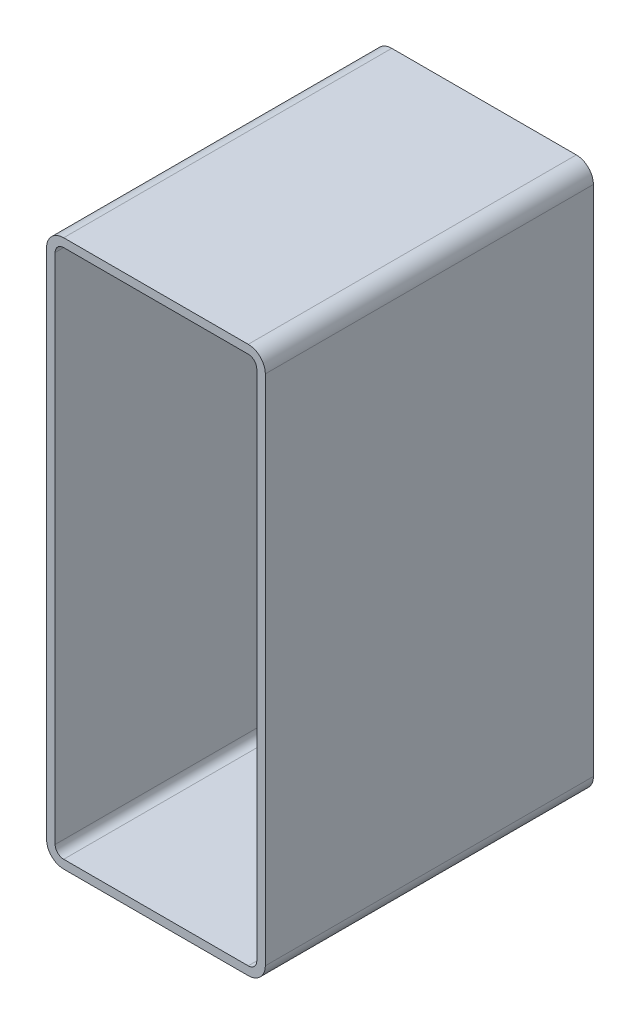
ISO-10303-21;
HEADER;
FILE_DESCRIPTION(('STEP AP214'),'2;1');
FILE_NAME('part.step','',(''),(''),'','','');
FILE_SCHEMA(('AUTOMOTIVE_DESIGN { 1 0 10303 214 1 1 1 1 }'));
ENDSEC;
DATA;
#1=APPLICATION_CONTEXT('core data for automotive mechanical design processes');
#2=APPLICATION_PROTOCOL_DEFINITION('international standard','automotive_design',2000,#1);
#3=PRODUCT_CONTEXT('',#1,'mechanical');
#4=PRODUCT('Part','Part','',(#3));
#5=PRODUCT_RELATED_PRODUCT_CATEGORY('part','',(#4));
#6=PRODUCT_DEFINITION_FORMATION('','',#4);
#7=PRODUCT_DEFINITION_CONTEXT('part definition',#1,'design');
#8=PRODUCT_DEFINITION('design','',#6,#7);
#9=PRODUCT_DEFINITION_SHAPE('','',#8);
#10=(LENGTH_UNIT() NAMED_UNIT(*) SI_UNIT(.MILLI.,.METRE.));
#11=(NAMED_UNIT(*) PLANE_ANGLE_UNIT() SI_UNIT($,.RADIAN.));
#12=(NAMED_UNIT(*) SI_UNIT($,.STERADIAN.) SOLID_ANGLE_UNIT());
#13=UNCERTAINTY_MEASURE_WITH_UNIT(LENGTH_MEASURE(1.E-05),#10,'distance_accuracy_value','');
#14=(GEOMETRIC_REPRESENTATION_CONTEXT(3) GLOBAL_UNCERTAINTY_ASSIGNED_CONTEXT((#13)) GLOBAL_UNIT_ASSIGNED_CONTEXT((#10,
#11,#12)) REPRESENTATION_CONTEXT('',''));
#15=CARTESIAN_POINT('',(0.,0.,0.));
#16=DIRECTION('',(0.,0.,1.));
#17=DIRECTION('',(1.,0.,0.));
#18=AXIS2_PLACEMENT_3D('',#15,#16,#17);
#19=CARTESIAN_POINT('',(17.2659404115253,17.5662282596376,304.8));
#20=DIRECTION('',(0.,0.,1.));
#21=DIRECTION('',(1.,0.,0.));
#22=AXIS2_PLACEMENT_3D('',#19,#20,#21);
#23=PLANE('',#22);
#24=CARTESIAN_POINT('',(17.2659404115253,17.5662282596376,304.8));
#25=DIRECTION('',(0.,0.,1.));
#26=DIRECTION('',(1.,0.,0.));
#27=AXIS2_PLACEMENT_3D('',#24,#25,#26);
#28=CIRCLE('',#27,15.875);
#29=CARTESIAN_POINT('',(1.3909404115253,17.5662282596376,304.8));
#30=VERTEX_POINT('',#29);
#31=CARTESIAN_POINT('',(17.2659404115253,1.69122825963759,304.8));
#32=VERTEX_POINT('',#31);
#33=EDGE_CURVE('E211',#30,#32,#28,.T.);
#34=ORIENTED_EDGE('',*,*,#33,.T.);
#35=DIRECTION('',(1.,0.,0.));
#36=VECTOR('',#35,1.);
#37=CARTESIAN_POINT('',(188.715940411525,1.69122825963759,304.8));
#38=LINE('',#37,#36);
#39=CARTESIAN_POINT('',(188.715940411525,1.69122825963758,304.8));
#40=VERTEX_POINT('',#39);
#41=EDGE_CURVE('E214',#32,#40,#38,.T.);
#42=ORIENTED_EDGE('',*,*,#41,.T.);
#43=CARTESIAN_POINT('',(188.715940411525,17.5662282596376,304.8));
#44=DIRECTION('',(0.,0.,1.));
#45=DIRECTION('',(1.,0.,0.));
#46=AXIS2_PLACEMENT_3D('',#43,#44,#45);
#47=CIRCLE('',#46,15.875);
#48=CARTESIAN_POINT('',(204.590940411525,17.5662282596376,304.8));
#49=VERTEX_POINT('',#48);
#50=EDGE_CURVE('E217',#40,#49,#47,.T.);
#51=ORIENTED_EDGE('',*,*,#50,.T.);
#52=DIRECTION('',(0.,1.,0.));
#53=VECTOR('',#52,1.);
#54=CARTESIAN_POINT('',(204.590940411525,493.816228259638,304.8));
#55=LINE('',#54,#53);
#56=CARTESIAN_POINT('',(204.590940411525,493.816228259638,304.8));
#57=VERTEX_POINT('',#56);
#58=EDGE_CURVE('E219',#49,#57,#55,.T.);
#59=ORIENTED_EDGE('',*,*,#58,.T.);
#60=CARTESIAN_POINT('',(188.715940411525,493.816228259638,304.8));
#61=DIRECTION('',(0.,0.,1.));
#62=DIRECTION('',(1.,0.,0.));
#63=AXIS2_PLACEMENT_3D('',#60,#61,#62);
#64=CIRCLE('',#63,15.875);
#65=CARTESIAN_POINT('',(188.715940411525,509.691228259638,304.8));
#66=VERTEX_POINT('',#65);
#67=EDGE_CURVE('E221',#57,#66,#64,.T.);
#68=ORIENTED_EDGE('',*,*,#67,.T.);
#69=DIRECTION('',(-1.,0.,0.));
#70=VECTOR('',#69,1.);
#71=CARTESIAN_POINT('',(17.2659404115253,509.691228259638,304.8));
#72=LINE('',#71,#70);
#73=CARTESIAN_POINT('',(17.2659404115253,509.691228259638,304.8));
#74=VERTEX_POINT('',#73);
#75=EDGE_CURVE('E223',#66,#74,#72,.T.);
#76=ORIENTED_EDGE('',*,*,#75,.T.);
#77=CARTESIAN_POINT('',(17.2659404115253,493.816228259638,304.8));
#78=DIRECTION('',(0.,0.,1.));
#79=DIRECTION('',(1.,0.,0.));
#80=AXIS2_PLACEMENT_3D('',#77,#78,#79);
#81=CIRCLE('',#80,15.875);
#82=CARTESIAN_POINT('',(1.3909404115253,493.816228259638,304.8));
#83=VERTEX_POINT('',#82);
#84=EDGE_CURVE('E225',#74,#83,#81,.T.);
#85=ORIENTED_EDGE('',*,*,#84,.T.);
#86=DIRECTION('',(0.,-1.,0.));
#87=VECTOR('',#86,1.);
#88=CARTESIAN_POINT('',(1.3909404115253,17.5662282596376,304.8));
#89=LINE('',#88,#87);
#90=EDGE_CURVE('E227',#83,#30,#89,.T.);
#91=ORIENTED_EDGE('',*,*,#90,.T.);
#92=EDGE_LOOP('',(#34,#42,#51,#59,#68,#76,#85,#91));
#93=FACE_BOUND('',#92,.T.);
#94=DIRECTION('',(0.,-1.,0.));
#95=VECTOR('',#94,1.);
#96=CARTESIAN_POINT('',(9.3284404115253,17.5662282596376,304.8));
#97=LINE('',#96,#95);
#98=CARTESIAN_POINT('',(9.3284404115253,493.816228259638,304.8));
#99=VERTEX_POINT('',#98);
#100=CARTESIAN_POINT('',(9.3284404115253,17.5662282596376,304.8));
#101=VERTEX_POINT('',#100);
#102=EDGE_CURVE('E154',#99,#101,#97,.T.);
#103=ORIENTED_EDGE('',*,*,#102,.F.);
#104=CARTESIAN_POINT('',(17.2659404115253,493.816228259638,304.8));
#105=DIRECTION('',(0.,0.,1.));
#106=DIRECTION('',(1.,0.,0.));
#107=AXIS2_PLACEMENT_3D('',#104,#105,#106);
#108=CIRCLE('',#107,7.93750000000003);
#109=CARTESIAN_POINT('',(17.2659404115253,501.753728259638,304.8));
#110=VERTEX_POINT('',#109);
#111=EDGE_CURVE('E146',#110,#99,#108,.T.);
#112=ORIENTED_EDGE('',*,*,#111,.F.);
#113=DIRECTION('',(-1.,0.,0.));
#114=VECTOR('',#113,1.);
#115=CARTESIAN_POINT('',(17.2659404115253,501.753728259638,304.8));
#116=LINE('',#115,#114);
#117=CARTESIAN_POINT('',(188.715940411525,501.753728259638,304.8));
#118=VERTEX_POINT('',#117);
#119=EDGE_CURVE('E179',#118,#110,#116,.T.);
#120=ORIENTED_EDGE('',*,*,#119,.F.);
#121=CARTESIAN_POINT('',(188.715940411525,493.816228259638,304.8));
#122=DIRECTION('',(0.,0.,1.));
#123=DIRECTION('',(1.,0.,0.));
#124=AXIS2_PLACEMENT_3D('',#121,#122,#123);
#125=CIRCLE('',#124,7.93750000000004);
#126=CARTESIAN_POINT('',(196.653440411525,493.816228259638,304.8));
#127=VERTEX_POINT('',#126);
#128=EDGE_CURVE('E177',#127,#118,#125,.T.);
#129=ORIENTED_EDGE('',*,*,#128,.F.);
#130=DIRECTION('',(0.,1.,0.));
#131=VECTOR('',#130,1.);
#132=CARTESIAN_POINT('',(196.653440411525,493.816228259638,304.8));
#133=LINE('',#132,#131);
#134=CARTESIAN_POINT('',(196.653440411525,17.5662282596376,304.8));
#135=VERTEX_POINT('',#134);
#136=EDGE_CURVE('E175',#135,#127,#133,.T.);
#137=ORIENTED_EDGE('',*,*,#136,.F.);
#138=CARTESIAN_POINT('',(188.715940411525,17.5662282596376,304.8));
#139=DIRECTION('',(0.,0.,1.));
#140=DIRECTION('',(1.,0.,0.));
#141=AXIS2_PLACEMENT_3D('',#138,#139,#140);
#142=CIRCLE('',#141,7.93750000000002);
#143=CARTESIAN_POINT('',(188.715940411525,9.62872825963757,304.8));
#144=VERTEX_POINT('',#143);
#145=EDGE_CURVE('E173',#144,#135,#142,.T.);
#146=ORIENTED_EDGE('',*,*,#145,.F.);
#147=DIRECTION('',(1.,0.,0.));
#148=VECTOR('',#147,1.);
#149=CARTESIAN_POINT('',(188.715940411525,9.62872825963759,304.8));
#150=LINE('',#149,#148);
#151=CARTESIAN_POINT('',(17.2659404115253,9.62872825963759,304.8));
#152=VERTEX_POINT('',#151);
#153=EDGE_CURVE('E169',#152,#144,#150,.T.);
#154=ORIENTED_EDGE('',*,*,#153,.F.);
#155=CARTESIAN_POINT('',(17.2659404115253,17.5662282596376,304.8));
#156=DIRECTION('',(0.,0.,1.));
#157=DIRECTION('',(1.,0.,0.));
#158=AXIS2_PLACEMENT_3D('',#155,#156,#157);
#159=CIRCLE('',#158,7.9375);
#160=EDGE_CURVE('E167',#101,#152,#159,.T.);
#161=ORIENTED_EDGE('',*,*,#160,.F.);
#162=EDGE_LOOP('',(#103,#112,#120,#129,#137,#146,#154,#161));
#163=FACE_BOUND('',#162,.T.);
#164=ADVANCED_FACE('F33',(#93,#163),#23,.T.);
#165=CARTESIAN_POINT('',(17.2659404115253,17.5662282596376,0.));
#166=DIRECTION('',(0.,0.,1.));
#167=DIRECTION('',(1.,0.,0.));
#168=AXIS2_PLACEMENT_3D('',#165,#166,#167);
#169=PLANE('',#168);
#170=CARTESIAN_POINT('',(17.2659404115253,17.5662282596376,0.));
#171=DIRECTION('',(0.,0.,1.));
#172=DIRECTION('',(1.,0.,0.));
#173=AXIS2_PLACEMENT_3D('',#170,#171,#172);
#174=CIRCLE('',#173,15.875);
#175=CARTESIAN_POINT('',(1.3909404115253,17.5662282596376,0.));
#176=VERTEX_POINT('',#175);
#177=CARTESIAN_POINT('',(17.2659404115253,1.69122825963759,0.));
#178=VERTEX_POINT('',#177);
#179=EDGE_CURVE('E162',#176,#178,#174,.T.);
#180=ORIENTED_EDGE('',*,*,#179,.F.);
#181=DIRECTION('',(0.,-1.,0.));
#182=VECTOR('',#181,1.);
#183=CARTESIAN_POINT('',(1.3909404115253,17.5662282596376,0.));
#184=LINE('',#183,#182);
#185=CARTESIAN_POINT('',(1.3909404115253,493.816228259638,0.));
#186=VERTEX_POINT('',#185);
#187=EDGE_CURVE('E215',#186,#176,#184,.T.);
#188=ORIENTED_EDGE('',*,*,#187,.F.);
#189=CARTESIAN_POINT('',(17.2659404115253,493.816228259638,0.));
#190=DIRECTION('',(0.,0.,1.));
#191=DIRECTION('',(1.,0.,0.));
#192=AXIS2_PLACEMENT_3D('',#189,#190,#191);
#193=CIRCLE('',#192,15.875);
#194=CARTESIAN_POINT('',(17.2659404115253,509.691228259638,0.));
#195=VERTEX_POINT('',#194);
#196=EDGE_CURVE('E242',#195,#186,#193,.T.);
#197=ORIENTED_EDGE('',*,*,#196,.F.);
#198=DIRECTION('',(-1.,0.,0.));
#199=VECTOR('',#198,1.);
#200=CARTESIAN_POINT('',(17.2659404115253,509.691228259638,0.));
#201=LINE('',#200,#199);
#202=CARTESIAN_POINT('',(188.715940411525,509.691228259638,0.));
#203=VERTEX_POINT('',#202);
#204=EDGE_CURVE('E240',#203,#195,#201,.T.);
#205=ORIENTED_EDGE('',*,*,#204,.F.);
#206=CARTESIAN_POINT('',(188.715940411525,493.816228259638,0.));
#207=DIRECTION('',(0.,0.,1.));
#208=DIRECTION('',(1.,0.,0.));
#209=AXIS2_PLACEMENT_3D('',#206,#207,#208);
#210=CIRCLE('',#209,15.875);
#211=CARTESIAN_POINT('',(204.590940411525,493.816228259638,0.));
#212=VERTEX_POINT('',#211);
#213=EDGE_CURVE('E238',#212,#203,#210,.T.);
#214=ORIENTED_EDGE('',*,*,#213,.F.);
#215=DIRECTION('',(0.,1.,0.));
#216=VECTOR('',#215,1.);
#217=CARTESIAN_POINT('',(204.590940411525,493.816228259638,0.));
#218=LINE('',#217,#216);
#219=CARTESIAN_POINT('',(204.590940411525,17.5662282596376,0.));
#220=VERTEX_POINT('',#219);
#221=EDGE_CURVE('E236',#220,#212,#218,.T.);
#222=ORIENTED_EDGE('',*,*,#221,.F.);
#223=CARTESIAN_POINT('',(188.715940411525,17.5662282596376,0.));
#224=DIRECTION('',(0.,0.,1.));
#225=DIRECTION('',(1.,0.,0.));
#226=AXIS2_PLACEMENT_3D('',#223,#224,#225);
#227=CIRCLE('',#226,15.875);
#228=CARTESIAN_POINT('',(188.715940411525,1.69122825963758,0.));
#229=VERTEX_POINT('',#228);
#230=EDGE_CURVE('E234',#229,#220,#227,.T.);
#231=ORIENTED_EDGE('',*,*,#230,.F.);
#232=DIRECTION('',(1.,0.,0.));
#233=VECTOR('',#232,1.);
#234=CARTESIAN_POINT('',(188.715940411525,1.69122825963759,0.));
#235=LINE('',#234,#233);
#236=EDGE_CURVE('E232',#178,#229,#235,.T.);
#237=ORIENTED_EDGE('',*,*,#236,.F.);
#238=EDGE_LOOP('',(#180,#188,#197,#205,#214,#222,#231,#237));
#239=FACE_BOUND('',#238,.T.);
#240=CARTESIAN_POINT('',(17.2659404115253,493.816228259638,0.));
#241=DIRECTION('',(0.,0.,1.));
#242=DIRECTION('',(1.,0.,0.));
#243=AXIS2_PLACEMENT_3D('',#240,#241,#242);
#244=CIRCLE('',#243,7.93750000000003);
#245=CARTESIAN_POINT('',(17.2659404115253,501.753728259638,0.));
#246=VERTEX_POINT('',#245);
#247=CARTESIAN_POINT('',(9.3284404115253,493.816228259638,0.));
#248=VERTEX_POINT('',#247);
#249=EDGE_CURVE('E56',#246,#248,#244,.T.);
#250=ORIENTED_EDGE('',*,*,#249,.T.);
#251=DIRECTION('',(0.,-1.,0.));
#252=VECTOR('',#251,1.);
#253=CARTESIAN_POINT('',(9.3284404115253,17.5662282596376,0.));
#254=LINE('',#253,#252);
#255=CARTESIAN_POINT('',(9.3284404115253,17.5662282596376,0.));
#256=VERTEX_POINT('',#255);
#257=EDGE_CURVE('E161',#248,#256,#254,.T.);
#258=ORIENTED_EDGE('',*,*,#257,.T.);
#259=CARTESIAN_POINT('',(17.2659404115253,17.5662282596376,0.));
#260=DIRECTION('',(0.,0.,1.));
#261=DIRECTION('',(1.,0.,0.));
#262=AXIS2_PLACEMENT_3D('',#259,#260,#261);
#263=CIRCLE('',#262,7.9375);
#264=CARTESIAN_POINT('',(17.2659404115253,9.62872825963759,0.));
#265=VERTEX_POINT('',#264);
#266=EDGE_CURVE('E183',#256,#265,#263,.T.);
#267=ORIENTED_EDGE('',*,*,#266,.T.);
#268=DIRECTION('',(1.,0.,0.));
#269=VECTOR('',#268,1.);
#270=CARTESIAN_POINT('',(188.715940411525,9.62872825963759,0.));
#271=LINE('',#270,#269);
#272=CARTESIAN_POINT('',(188.715940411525,9.62872825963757,0.));
#273=VERTEX_POINT('',#272);
#274=EDGE_CURVE('E186',#265,#273,#271,.T.);
#275=ORIENTED_EDGE('',*,*,#274,.T.);
#276=CARTESIAN_POINT('',(188.715940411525,17.5662282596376,0.));
#277=DIRECTION('',(0.,0.,1.));
#278=DIRECTION('',(1.,0.,0.));
#279=AXIS2_PLACEMENT_3D('',#276,#277,#278);
#280=CIRCLE('',#279,7.93750000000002);
#281=CARTESIAN_POINT('',(196.653440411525,17.5662282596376,0.));
#282=VERTEX_POINT('',#281);
#283=EDGE_CURVE('E189',#273,#282,#280,.T.);
#284=ORIENTED_EDGE('',*,*,#283,.T.);
#285=DIRECTION('',(0.,1.,0.));
#286=VECTOR('',#285,1.);
#287=CARTESIAN_POINT('',(196.653440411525,493.816228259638,0.));
#288=LINE('',#287,#286);
#289=CARTESIAN_POINT('',(196.653440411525,493.816228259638,0.));
#290=VERTEX_POINT('',#289);
#291=EDGE_CURVE('E192',#282,#290,#288,.T.);
#292=ORIENTED_EDGE('',*,*,#291,.T.);
#293=CARTESIAN_POINT('',(188.715940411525,493.816228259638,0.));
#294=DIRECTION('',(0.,0.,1.));
#295=DIRECTION('',(1.,0.,0.));
#296=AXIS2_PLACEMENT_3D('',#293,#294,#295);
#297=CIRCLE('',#296,7.93750000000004);
#298=CARTESIAN_POINT('',(188.715940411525,501.753728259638,0.));
#299=VERTEX_POINT('',#298);
#300=EDGE_CURVE('E195',#290,#299,#297,.T.);
#301=ORIENTED_EDGE('',*,*,#300,.T.);
#302=DIRECTION('',(-1.,0.,0.));
#303=VECTOR('',#302,1.);
#304=CARTESIAN_POINT('',(17.2659404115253,501.753728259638,0.));
#305=LINE('',#304,#303);
#306=EDGE_CURVE('E155',#299,#246,#305,.T.);
#307=ORIENTED_EDGE('',*,*,#306,.T.);
#308=EDGE_LOOP('',(#250,#258,#267,#275,#284,#292,#301,#307));
#309=FACE_BOUND('',#308,.T.);
#310=ADVANCED_FACE('F272',(#239,#309),#169,.F.);
#311=CARTESIAN_POINT('',(17.2659404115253,17.5662282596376,304.8));
#312=DIRECTION('',(0.,0.,-1.));
#313=DIRECTION('',(-1.,0.,0.));
#314=AXIS2_PLACEMENT_3D('',#311,#312,#313);
#315=CYLINDRICAL_SURFACE('',#314,15.875);
#316=ORIENTED_EDGE('',*,*,#179,.T.);
#317=DIRECTION('',(0.,0.,-1.));
#318=VECTOR('',#317,1.);
#319=CARTESIAN_POINT('',(17.2659404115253,1.69122825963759,304.8));
#320=LINE('',#319,#318);
#321=EDGE_CURVE('E11',#32,#178,#320,.T.);
#322=ORIENTED_EDGE('',*,*,#321,.F.);
#323=ORIENTED_EDGE('',*,*,#33,.F.);
#324=DIRECTION('',(0.,0.,-1.));
#325=VECTOR('',#324,1.);
#326=CARTESIAN_POINT('',(1.3909404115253,17.5662282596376,304.8));
#327=LINE('',#326,#325);
#328=EDGE_CURVE('E229',#30,#176,#327,.T.);
#329=ORIENTED_EDGE('',*,*,#328,.T.);
#330=EDGE_LOOP('',(#316,#322,#323,#329));
#331=FACE_BOUND('',#330,.T.);
#332=ADVANCED_FACE('F35',(#331),#315,.T.);
#333=CARTESIAN_POINT('',(188.715940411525,1.69122825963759,304.8));
#334=DIRECTION('',(0.,1.,0.));
#335=DIRECTION('',(0.,0.,1.));
#336=AXIS2_PLACEMENT_3D('',#333,#334,#335);
#337=PLANE('',#336);
#338=ORIENTED_EDGE('',*,*,#236,.T.);
#339=DIRECTION('',(0.,0.,-1.));
#340=VECTOR('',#339,1.);
#341=CARTESIAN_POINT('',(188.715940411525,1.69122825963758,304.8));
#342=LINE('',#341,#340);
#343=EDGE_CURVE('E41',#40,#229,#342,.T.);
#344=ORIENTED_EDGE('',*,*,#343,.F.);
#345=ORIENTED_EDGE('',*,*,#41,.F.);
#346=ORIENTED_EDGE('',*,*,#321,.T.);
#347=EDGE_LOOP('',(#338,#344,#345,#346));
#348=FACE_BOUND('',#347,.T.);
#349=ADVANCED_FACE('F289',(#348),#337,.F.);
#350=CARTESIAN_POINT('',(188.715940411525,17.5662282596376,304.8));
#351=DIRECTION('',(0.,0.,-1.));
#352=DIRECTION('',(-1.,0.,0.));
#353=AXIS2_PLACEMENT_3D('',#350,#351,#352);
#354=CYLINDRICAL_SURFACE('',#353,15.875);
#355=ORIENTED_EDGE('',*,*,#230,.T.);
#356=DIRECTION('',(0.,0.,-1.));
#357=VECTOR('',#356,1.);
#358=CARTESIAN_POINT('',(204.590940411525,17.5662282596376,304.8));
#359=LINE('',#358,#357);
#360=EDGE_CURVE('E259',#49,#220,#359,.T.);
#361=ORIENTED_EDGE('',*,*,#360,.F.);
#362=ORIENTED_EDGE('',*,*,#50,.F.);
#363=ORIENTED_EDGE('',*,*,#343,.T.);
#364=EDGE_LOOP('',(#355,#361,#362,#363));
#365=FACE_BOUND('',#364,.T.);
#366=ADVANCED_FACE('F266',(#365),#354,.T.);
#367=CARTESIAN_POINT('',(204.590940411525,493.816228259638,304.8));
#368=DIRECTION('',(-1.,0.,0.));
#369=DIRECTION('',(0.,0.,1.));
#370=AXIS2_PLACEMENT_3D('',#367,#368,#369);
#371=PLANE('',#370);
#372=ORIENTED_EDGE('',*,*,#221,.T.);
#373=DIRECTION('',(0.,0.,-1.));
#374=VECTOR('',#373,1.);
#375=CARTESIAN_POINT('',(204.590940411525,493.816228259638,304.8));
#376=LINE('',#375,#374);
#377=EDGE_CURVE('E256',#57,#212,#376,.T.);
#378=ORIENTED_EDGE('',*,*,#377,.F.);
#379=ORIENTED_EDGE('',*,*,#58,.F.);
#380=ORIENTED_EDGE('',*,*,#360,.T.);
#381=EDGE_LOOP('',(#372,#378,#379,#380));
#382=FACE_BOUND('',#381,.T.);
#383=ADVANCED_FACE('F278',(#382),#371,.F.);
#384=CARTESIAN_POINT('',(188.715940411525,493.816228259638,304.8));
#385=DIRECTION('',(0.,0.,-1.));
#386=DIRECTION('',(-1.,0.,0.));
#387=AXIS2_PLACEMENT_3D('',#384,#385,#386);
#388=CYLINDRICAL_SURFACE('',#387,15.875);
#389=ORIENTED_EDGE('',*,*,#213,.T.);
#390=DIRECTION('',(0.,0.,-1.));
#391=VECTOR('',#390,1.);
#392=CARTESIAN_POINT('',(188.715940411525,509.691228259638,304.8));
#393=LINE('',#392,#391);
#394=EDGE_CURVE('E253',#66,#203,#393,.T.);
#395=ORIENTED_EDGE('',*,*,#394,.F.);
#396=ORIENTED_EDGE('',*,*,#67,.F.);
#397=ORIENTED_EDGE('',*,*,#377,.T.);
#398=EDGE_LOOP('',(#389,#395,#396,#397));
#399=FACE_BOUND('',#398,.T.);
#400=ADVANCED_FACE('F282',(#399),#388,.T.);
#401=CARTESIAN_POINT('',(17.2659404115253,509.691228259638,304.8));
#402=DIRECTION('',(0.,-1.,0.));
#403=DIRECTION('',(0.,0.,-1.));
#404=AXIS2_PLACEMENT_3D('',#401,#402,#403);
#405=PLANE('',#404);
#406=ORIENTED_EDGE('',*,*,#204,.T.);
#407=DIRECTION('',(0.,0.,-1.));
#408=VECTOR('',#407,1.);
#409=CARTESIAN_POINT('',(17.2659404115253,509.691228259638,304.8));
#410=LINE('',#409,#408);
#411=EDGE_CURVE('E250',#74,#195,#410,.T.);
#412=ORIENTED_EDGE('',*,*,#411,.F.);
#413=ORIENTED_EDGE('',*,*,#75,.F.);
#414=ORIENTED_EDGE('',*,*,#394,.T.);
#415=EDGE_LOOP('',(#406,#412,#413,#414));
#416=FACE_BOUND('',#415,.T.);
#417=ADVANCED_FACE('F302',(#416),#405,.F.);
#418=CARTESIAN_POINT('',(17.2659404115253,493.816228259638,304.8));
#419=DIRECTION('',(0.,0.,-1.));
#420=DIRECTION('',(-1.,0.,0.));
#421=AXIS2_PLACEMENT_3D('',#418,#419,#420);
#422=CYLINDRICAL_SURFACE('',#421,15.875);
#423=ORIENTED_EDGE('',*,*,#196,.T.);
#424=DIRECTION('',(0.,0.,-1.));
#425=VECTOR('',#424,1.);
#426=CARTESIAN_POINT('',(1.3909404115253,493.816228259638,304.8));
#427=LINE('',#426,#425);
#428=EDGE_CURVE('E247',#83,#186,#427,.T.);
#429=ORIENTED_EDGE('',*,*,#428,.F.);
#430=ORIENTED_EDGE('',*,*,#84,.F.);
#431=ORIENTED_EDGE('',*,*,#411,.T.);
#432=EDGE_LOOP('',(#423,#429,#430,#431));
#433=FACE_BOUND('',#432,.T.);
#434=ADVANCED_FACE('F300',(#433),#422,.T.);
#435=CARTESIAN_POINT('',(1.3909404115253,17.5662282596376,304.8));
#436=DIRECTION('',(1.,0.,0.));
#437=DIRECTION('',(0.,0.,-1.));
#438=AXIS2_PLACEMENT_3D('',#435,#436,#437);
#439=PLANE('',#438);
#440=ORIENTED_EDGE('',*,*,#187,.T.);
#441=ORIENTED_EDGE('',*,*,#328,.F.);
#442=ORIENTED_EDGE('',*,*,#90,.F.);
#443=ORIENTED_EDGE('',*,*,#428,.T.);
#444=EDGE_LOOP('',(#440,#441,#442,#443));
#445=FACE_BOUND('',#444,.T.);
#446=ADVANCED_FACE('F295',(#445),#439,.F.);
#447=CARTESIAN_POINT('',(17.2659404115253,493.816228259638,304.8));
#448=DIRECTION('',(0.,0.,-1.));
#449=DIRECTION('',(-1.,0.,0.));
#450=AXIS2_PLACEMENT_3D('',#447,#448,#449);
#451=CYLINDRICAL_SURFACE('',#450,7.93750000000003);
#452=ORIENTED_EDGE('',*,*,#249,.F.);
#453=DIRECTION('',(0.,0.,-1.));
#454=VECTOR('',#453,1.);
#455=CARTESIAN_POINT('',(17.2659404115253,501.753728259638,304.8));
#456=LINE('',#455,#454);
#457=EDGE_CURVE('E150',#110,#246,#456,.T.);
#458=ORIENTED_EDGE('',*,*,#457,.F.);
#459=ORIENTED_EDGE('',*,*,#111,.T.);
#460=DIRECTION('',(0.,0.,-1.));
#461=VECTOR('',#460,1.);
#462=CARTESIAN_POINT('',(9.3284404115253,493.816228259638,304.8));
#463=LINE('',#462,#461);
#464=EDGE_CURVE('E149',#99,#248,#463,.T.);
#465=ORIENTED_EDGE('',*,*,#464,.T.);
#466=EDGE_LOOP('',(#452,#458,#459,#465));
#467=FACE_BOUND('',#466,.T.);
#468=ADVANCED_FACE('F148',(#467),#451,.F.);
#469=CARTESIAN_POINT('',(9.3284404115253,17.5662282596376,304.8));
#470=DIRECTION('',(1.,0.,0.));
#471=DIRECTION('',(0.,0.,-1.));
#472=AXIS2_PLACEMENT_3D('',#469,#470,#471);
#473=PLANE('',#472);
#474=ORIENTED_EDGE('',*,*,#257,.F.);
#475=ORIENTED_EDGE('',*,*,#464,.F.);
#476=ORIENTED_EDGE('',*,*,#102,.T.);
#477=DIRECTION('',(0.,0.,-1.));
#478=VECTOR('',#477,1.);
#479=CARTESIAN_POINT('',(9.3284404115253,17.5662282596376,304.8));
#480=LINE('',#479,#478);
#481=EDGE_CURVE('E163',#101,#256,#480,.T.);
#482=ORIENTED_EDGE('',*,*,#481,.T.);
#483=EDGE_LOOP('',(#474,#475,#476,#482));
#484=FACE_BOUND('',#483,.T.);
#485=ADVANCED_FACE('F158',(#484),#473,.T.);
#486=CARTESIAN_POINT('',(17.2659404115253,17.5662282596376,304.8));
#487=DIRECTION('',(0.,0.,-1.));
#488=DIRECTION('',(-1.,0.,0.));
#489=AXIS2_PLACEMENT_3D('',#486,#487,#488);
#490=CYLINDRICAL_SURFACE('',#489,7.9375);
#491=ORIENTED_EDGE('',*,*,#266,.F.);
#492=ORIENTED_EDGE('',*,*,#481,.F.);
#493=ORIENTED_EDGE('',*,*,#160,.T.);
#494=DIRECTION('',(0.,0.,-1.));
#495=VECTOR('',#494,1.);
#496=CARTESIAN_POINT('',(17.2659404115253,9.62872825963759,304.8));
#497=LINE('',#496,#495);
#498=EDGE_CURVE('E208',#152,#265,#497,.T.);
#499=ORIENTED_EDGE('',*,*,#498,.T.);
#500=EDGE_LOOP('',(#491,#492,#493,#499));
#501=FACE_BOUND('',#500,.T.);
#502=ADVANCED_FACE('F327',(#501),#490,.F.);
#503=CARTESIAN_POINT('',(188.715940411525,9.62872825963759,304.8));
#504=DIRECTION('',(0.,1.,0.));
#505=DIRECTION('',(0.,0.,1.));
#506=AXIS2_PLACEMENT_3D('',#503,#504,#505);
#507=PLANE('',#506);
#508=ORIENTED_EDGE('',*,*,#274,.F.);
#509=ORIENTED_EDGE('',*,*,#498,.F.);
#510=ORIENTED_EDGE('',*,*,#153,.T.);
#511=DIRECTION('',(0.,0.,-1.));
#512=VECTOR('',#511,1.);
#513=CARTESIAN_POINT('',(188.715940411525,9.62872825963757,304.8));
#514=LINE('',#513,#512);
#515=EDGE_CURVE('E206',#144,#273,#514,.T.);
#516=ORIENTED_EDGE('',*,*,#515,.T.);
#517=EDGE_LOOP('',(#508,#509,#510,#516));
#518=FACE_BOUND('',#517,.T.);
#519=ADVANCED_FACE('F331',(#518),#507,.T.);
#520=CARTESIAN_POINT('',(188.715940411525,17.5662282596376,304.8));
#521=DIRECTION('',(0.,0.,-1.));
#522=DIRECTION('',(-1.,0.,0.));
#523=AXIS2_PLACEMENT_3D('',#520,#521,#522);
#524=CYLINDRICAL_SURFACE('',#523,7.93750000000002);
#525=ORIENTED_EDGE('',*,*,#283,.F.);
#526=ORIENTED_EDGE('',*,*,#515,.F.);
#527=ORIENTED_EDGE('',*,*,#145,.T.);
#528=DIRECTION('',(0.,0.,-1.));
#529=VECTOR('',#528,1.);
#530=CARTESIAN_POINT('',(196.653440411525,17.5662282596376,304.8));
#531=LINE('',#530,#529);
#532=EDGE_CURVE('E204',#135,#282,#531,.T.);
#533=ORIENTED_EDGE('',*,*,#532,.T.);
#534=EDGE_LOOP('',(#525,#526,#527,#533));
#535=FACE_BOUND('',#534,.T.);
#536=ADVANCED_FACE('F337',(#535),#524,.F.);
#537=CARTESIAN_POINT('',(196.653440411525,493.816228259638,304.8));
#538=DIRECTION('',(-1.,0.,0.));
#539=DIRECTION('',(0.,0.,1.));
#540=AXIS2_PLACEMENT_3D('',#537,#538,#539);
#541=PLANE('',#540);
#542=ORIENTED_EDGE('',*,*,#291,.F.);
#543=ORIENTED_EDGE('',*,*,#532,.F.);
#544=ORIENTED_EDGE('',*,*,#136,.T.);
#545=DIRECTION('',(0.,0.,-1.));
#546=VECTOR('',#545,1.);
#547=CARTESIAN_POINT('',(196.653440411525,493.816228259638,304.8));
#548=LINE('',#547,#546);
#549=EDGE_CURVE('E202',#127,#290,#548,.T.);
#550=ORIENTED_EDGE('',*,*,#549,.T.);
#551=EDGE_LOOP('',(#542,#543,#544,#550));
#552=FACE_BOUND('',#551,.T.);
#553=ADVANCED_FACE('F341',(#552),#541,.T.);
#554=CARTESIAN_POINT('',(188.715940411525,493.816228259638,304.8));
#555=DIRECTION('',(0.,0.,-1.));
#556=DIRECTION('',(-1.,0.,0.));
#557=AXIS2_PLACEMENT_3D('',#554,#555,#556);
#558=CYLINDRICAL_SURFACE('',#557,7.93750000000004);
#559=ORIENTED_EDGE('',*,*,#300,.F.);
#560=ORIENTED_EDGE('',*,*,#549,.F.);
#561=ORIENTED_EDGE('',*,*,#128,.T.);
#562=DIRECTION('',(0.,0.,-1.));
#563=VECTOR('',#562,1.);
#564=CARTESIAN_POINT('',(188.715940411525,501.753728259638,304.8));
#565=LINE('',#564,#563);
#566=EDGE_CURVE('E48',#118,#299,#565,.T.);
#567=ORIENTED_EDGE('',*,*,#566,.T.);
#568=EDGE_LOOP('',(#559,#560,#561,#567));
#569=FACE_BOUND('',#568,.T.);
#570=ADVANCED_FACE('F345',(#569),#558,.F.);
#571=CARTESIAN_POINT('',(17.2659404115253,501.753728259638,304.8));
#572=DIRECTION('',(0.,-1.,0.));
#573=DIRECTION('',(0.,0.,-1.));
#574=AXIS2_PLACEMENT_3D('',#571,#572,#573);
#575=PLANE('',#574);
#576=ORIENTED_EDGE('',*,*,#306,.F.);
#577=ORIENTED_EDGE('',*,*,#566,.F.);
#578=ORIENTED_EDGE('',*,*,#119,.T.);
#579=ORIENTED_EDGE('',*,*,#457,.T.);
#580=EDGE_LOOP('',(#576,#577,#578,#579));
#581=FACE_BOUND('',#580,.T.);
#582=ADVANCED_FACE('F349',(#581),#575,.T.);
#583=CLOSED_SHELL('',(#164,#310,#332,#349,#366,#383,#400,#417,#434,#446,#468,#485,#502,#519,
#536,#553,#570,#582));
#584=MANIFOLD_SOLID_BREP('B2',#583);
#585=ADVANCED_BREP_SHAPE_REPRESENTATION('',(#18,#584),#14);
#586=SHAPE_DEFINITION_REPRESENTATION(#9,#585);
ENDSEC;
END-ISO-10303-21;
